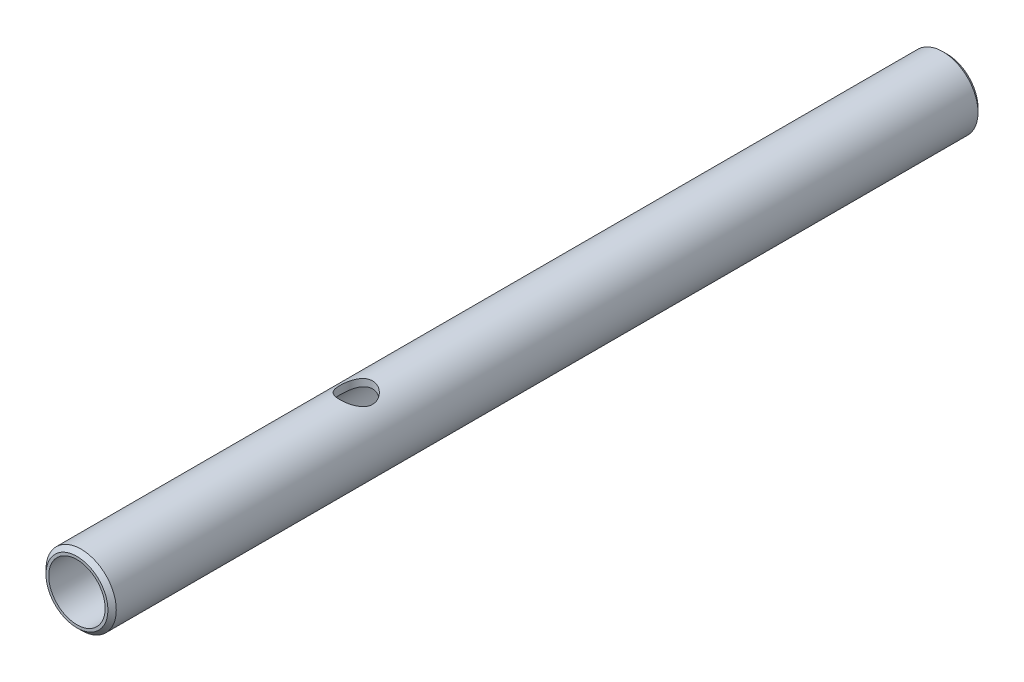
from build123d import *

# Parameters (mm, degrees)
SKETCH1_R           = 10.668
SKETCH1_R_2         = 8.5598
BOSS_EXTRUDE1_DEPTH = 263.906
CHAMFER1_SIZE       = 1.27
SKETCH2_R           = 4.96062
CUT_EXTRUDE1_DEPTH  = 265.336885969


with BuildPart() as part:
    # Sketch1 → Boss-Extrude1 (new body)
    with BuildSketch(Plane.XY):
        Circle(SKETCH1_R)
        Circle(SKETCH1_R_2, mode=Mode.SUBTRACT)
    extrude(amount=BOSS_EXTRUDE1_DEPTH)

    # Chamfer1
    chamfer1_edges = [part.edges().sort_by_distance(p)[0] for p in [
        (-10.668, 0, 0),
        (-10.668, 0, 263.906),
    ]]
    chamfer(chamfer1_edges, length=CHAMFER1_SIZE)

    # Sketch2 → Cut-Extrude1 (cut, through all)
    with BuildSketch(Plane(origin=(0, 0, 0), x_dir=(1, 0, 0), z_dir=(0, 1, 0))):
        with Locations(Location((0, -179.197, 0), (0, 0, 90))):
            Circle(SKETCH2_R)
    extrude(amount=CUT_EXTRUDE1_DEPTH, mode=Mode.SUBTRACT)


solid = part.part
